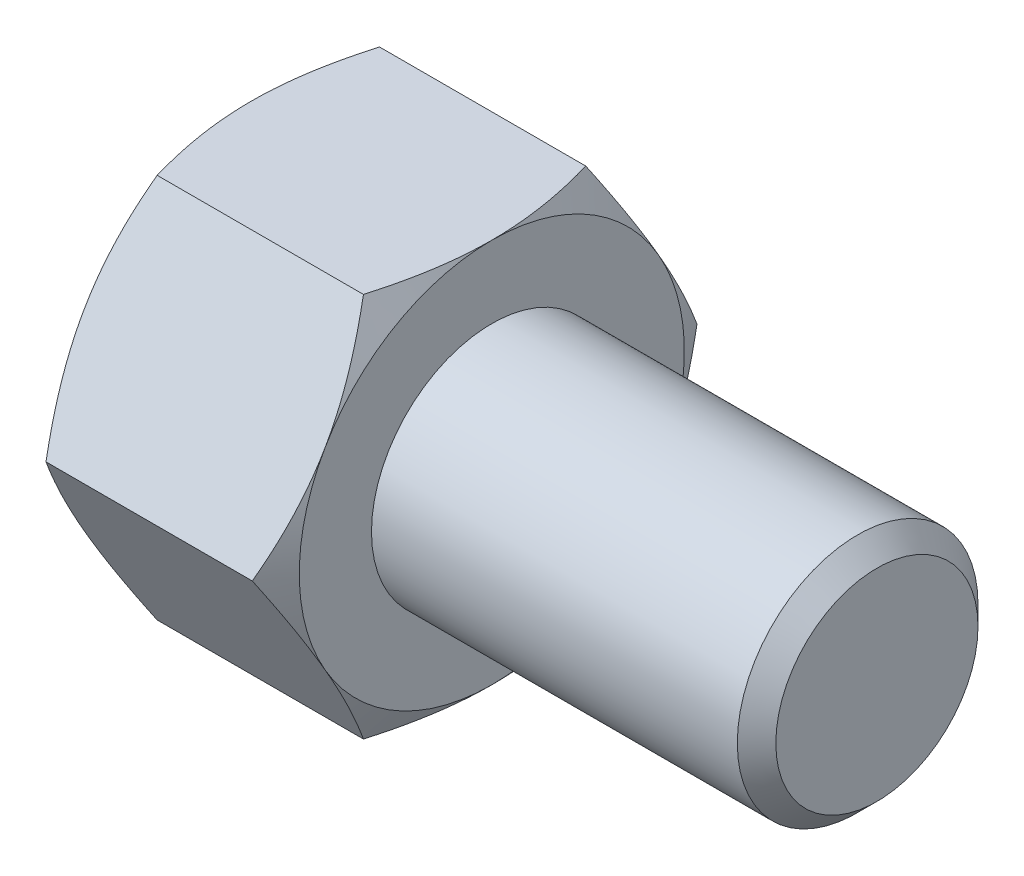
from build123d import *

# Parameters (mm, degrees)
EXTRUDE2_DEPTH = 2.5
SKETCH3_R      = 2.1
EXTRUDE3_DEPTH = 3
SKETCH5_R      = 2.5
EXTRUDE4_DEPTH = 8
CHAMFER1_SIZE  = 0.4


with BuildPart() as part:
    # Sketch1 → Extrude2 (new, symmetric)
    with BuildSketch(Plane(origin=(0, 0, 0), x_dir=(0, 0, -1), z_dir=(1, 0, 0))):
        Polygon((2.309401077, 4), (-2.309401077, 4), (-4.618802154, 0), (-2.309401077, -4), (2.309401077, -4), (4.618802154, 0), align=None)
    extrude(amount=EXTRUDE2_DEPTH, both=True)

    # Sketch2 → Cut-Revolve1 (revolve, cut)
    with BuildSketch(Plane.XY):
        with BuildLine():
            Line((-2.5, 4), (-1, 6.598076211))
            ThreePointArc((-1, 6.598076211), (-1.48810136, 7.776457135), (-2.5, 7))
            Line((-2.5, 7), (-2.5, 4))
        make_face()
    cut_revolve1 = revolve(axis=Axis((0, 0, 0), (1, 0, 0)), mode=Mode.SUBTRACT)

    # Mirror1: Cut-Revolve1 across plane
    add(cut_revolve1.mirror(Plane(origin=(0, 0, 0), x_dir=(0, 0, 1), z_dir=(1, 0, 0))), mode=Mode.SUBTRACT)

    # Sketch3 → Extrude3 (cut)
    with BuildSketch(Plane.ZY.offset(2.5)):
        Circle(SKETCH3_R)
    extrude(amount=-EXTRUDE3_DEPTH, mode=Mode.SUBTRACT)

    # Sketch4 → Cut-Revolve2 (revolve, cut)
    with BuildSketch(Plane.XY, mode=Mode.PRIVATE) as cut_revolve2_sk:
        Polygon((0.5, 0), (0.5, 2.1), (1.712435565, 0), align=None)
    revolve(cut_revolve2_sk.sketch.rotate(Axis((1.712435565, 0, 0), (-1, 0, 0)), 180), axis=Axis((1.712435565, 0, 0), (-1, 0, 0)), mode=Mode.SUBTRACT)

    # Sketch5 → Extrude4 (add)
    with BuildSketch(Plane(origin=(2.5, 0, 0), x_dir=(0, 0, -1), z_dir=(1, 0, 0))):
        Circle(SKETCH5_R)
    extrude(amount=EXTRUDE4_DEPTH)

    # Chamfer1
    chamfer1_edges = [part.edges().sort_by_distance(p)[0] for p in [
        (10.5, 0, 2.5),
    ]]
    chamfer(chamfer1_edges, length=CHAMFER1_SIZE)


solid = part.part
